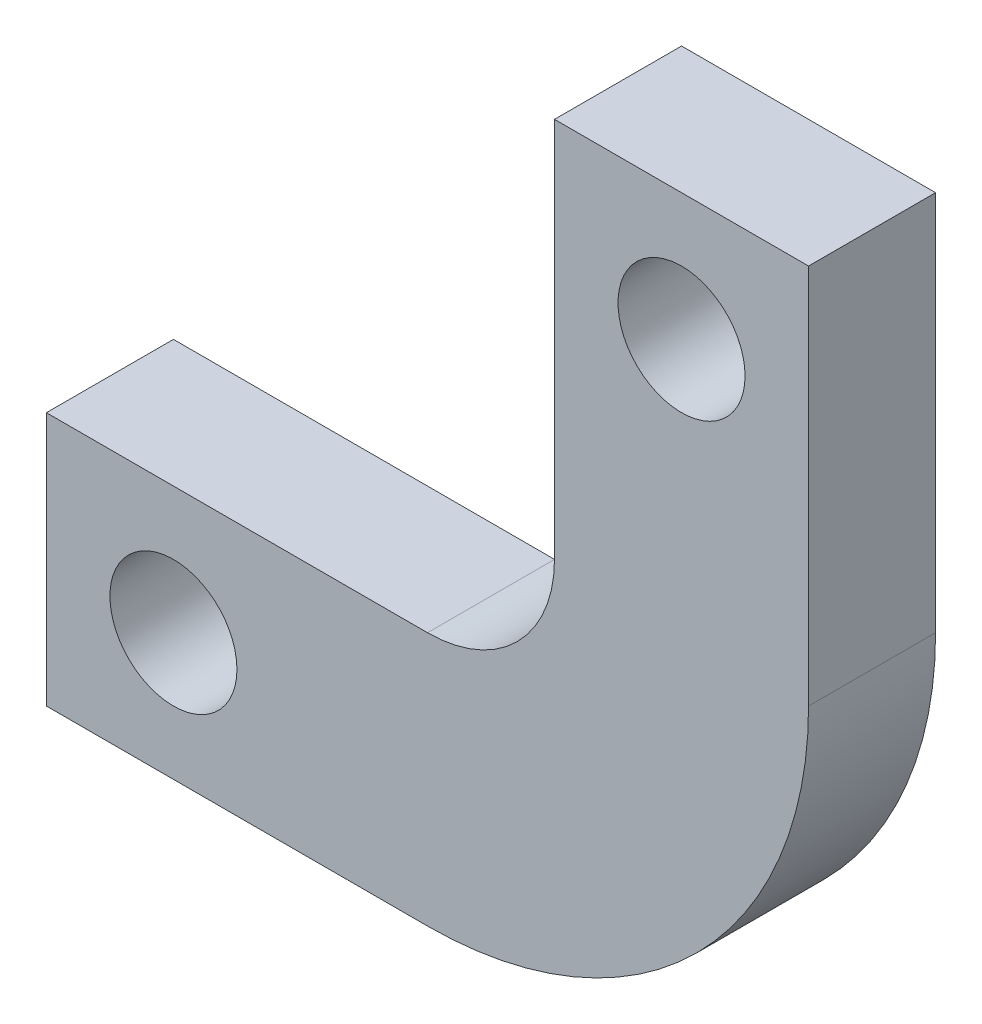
from build123d import *

# Parameters (mm, degrees)
SKETCH1_R           = 3
BOSS_EXTRUDE1_DEPTH = 3


with BuildPart() as part:
    # Sketch1 → Boss-Extrude1 (new, symmetric)
    with BuildSketch(Plane.XY):
        with BuildLine():
            Line((0, 0), (18, 0))
            ThreePointArc((18, 0), (30.727922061, 5.272077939), (36, 18))
            Line((36, 18), (36, 36))
            Line((36, 36), (24, 36))
            Line((24, 36), (24, 18))
            ThreePointArc((24, 18), (22.242640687, 13.757359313), (18, 12))
            Line((18, 12), (0, 12))
            Line((0, 12), (0, 0))
        make_face()
        with Locations((6, 6)):
            Circle(SKETCH1_R, mode=Mode.SUBTRACT)
        with Locations((30, 30)):
            Circle(SKETCH1_R, mode=Mode.SUBTRACT)
    extrude(amount=BOSS_EXTRUDE1_DEPTH, both=True)


solid = part.part
